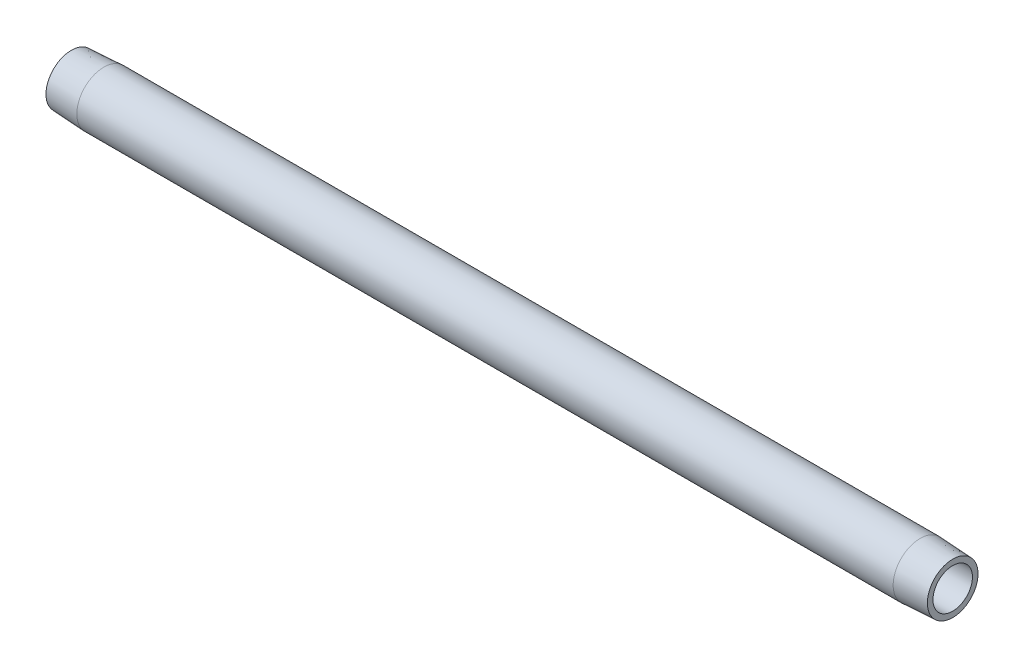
from build123d import *


with BuildPart() as part:
    # Sketch1 → Revolve1 (revolve)
    with BuildSketch(Plane.XY, mode=Mode.PRIVATE) as revolve1_sk:
        Polygon((279.4, 6.2611), (0, 6.2611), (0, 8.032050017), (10.3124, 8.5725), (269.0876, 8.5725), (279.4, 8.032050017), align=None)
    revolve(revolve1_sk.sketch.rotate(Axis((0, 0, 0), (1, 0, 0)), 90), axis=Axis((0, 0, 0), (1, 0, 0)))


solid = part.part
